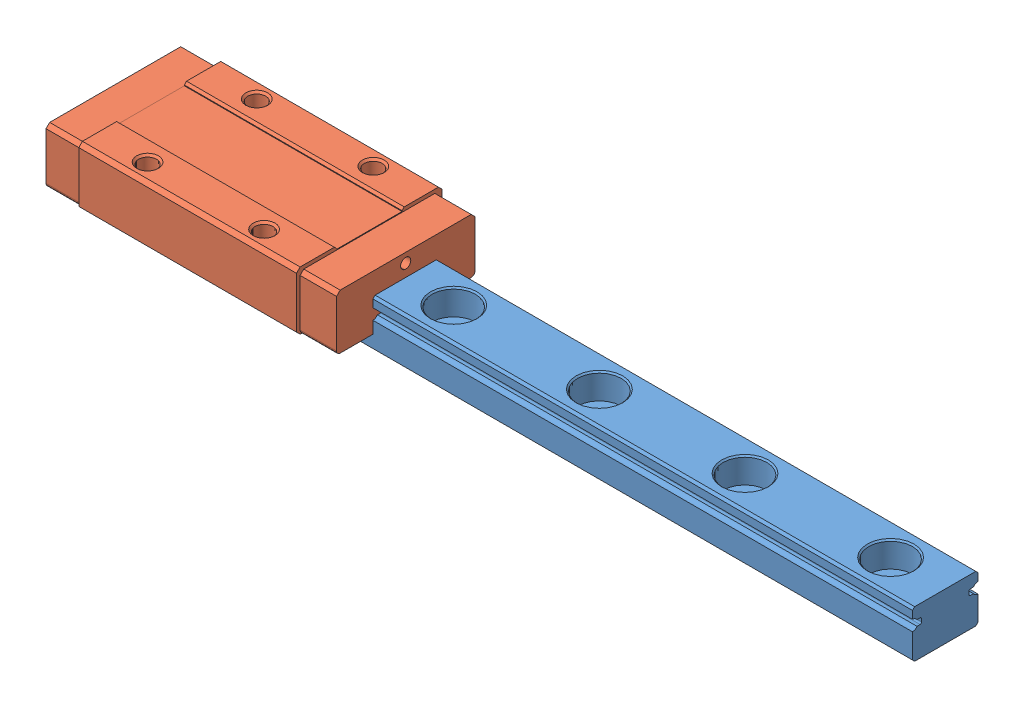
SolidWorks assembly MLN9H.stp.SLDASM, configuration 默认 (file format 13000). Lengths in mm.
Overall size (115 10 20).
2 component instances, 2 part files, 0 mates.
Components (placement in the parent):
- MLNR9R115 E=7.5-1: MLNR9R115 E=7.5.SLDPRT [默认] at origin size (115 6.5 9)
- MLN9H-1: MLN9H.SLDPRT [默认] at (1 2 0) size (39.9 8 20)
